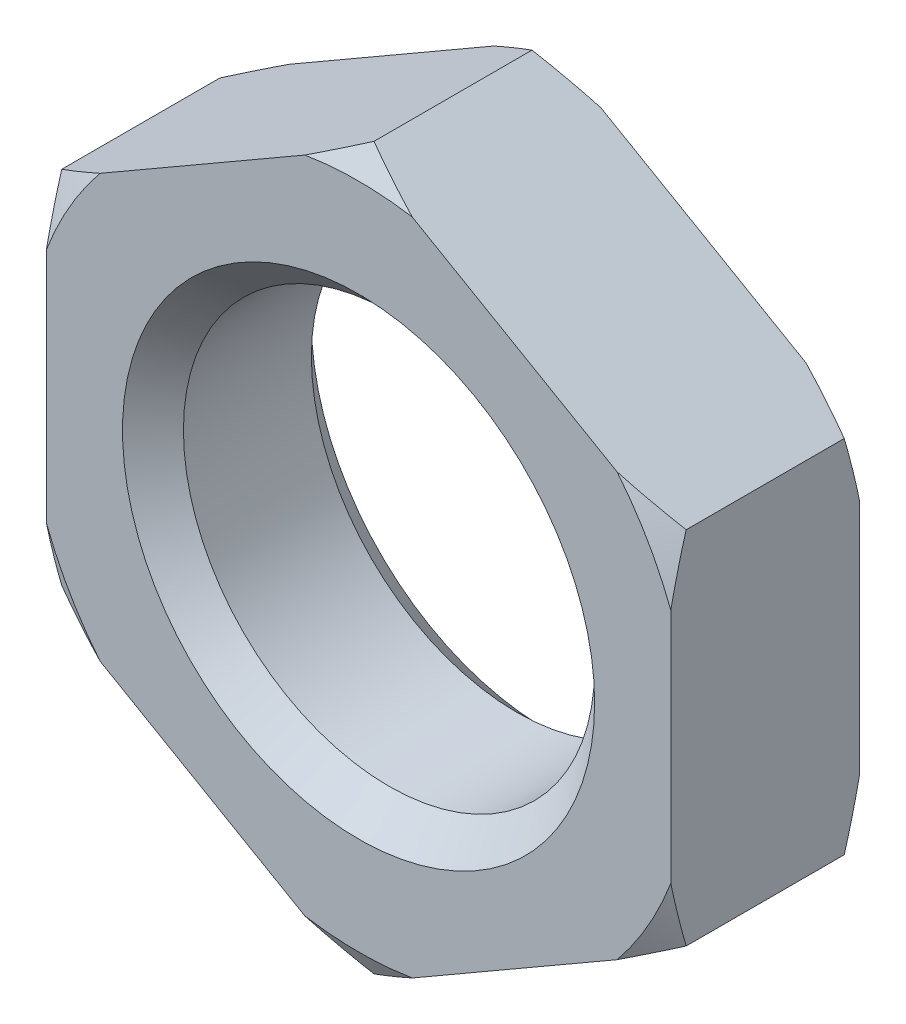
from build123d import *

# Parameters (mm, degrees)
SKETCH1_R           = 13.5
BOSS_EXTRUDE1_DEPTH = 6.2
CHAMFER1_SIZE       = 2


with BuildPart() as part:
    # Sketch1 → Boss-Extrude1 (new, symmetric)
    with BuildSketch(Plane.XY):
        Polygon((0, 23.671361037), (-20.5, 11.835680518), (-20.5, -11.835680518), (0, -23.671361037), (20.5, -11.835680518), (20.5, 11.835680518), align=None)
        with Locations(Location((0, 0, 0), (0, 0, 180))):
            Circle(SKETCH1_R, mode=Mode.SUBTRACT)
    extrude(amount=BOSS_EXTRUDE1_DEPTH, both=True)

    # Sketch3 → Cut-Revolve1 (revolve, cut)
    with BuildSketch(Plane(origin=(0, 0, 0), x_dir=(0, 0, -1), z_dir=(1, 0, 0))):
        Polygon((-6.2, 23.671361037), (-6.2, 21.921361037), (-5.189637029, 23.671361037), align=None)
    cut_revolve1 = revolve(axis=Axis((0, 0, -7.477018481), (0, 0, 1)), mode=Mode.SUBTRACT)

    # Mirror1: Cut-Revolve1 across plane
    add(cut_revolve1.mirror(Plane.XY), mode=Mode.SUBTRACT)

    # Chamfer1
    chamfer1_edges = [part.edges().sort_by_distance(p)[0] for p in [
        (13.5, 0, -6.2),
        (13.5, 0, 6.2),
    ]]
    chamfer(chamfer1_edges, length=CHAMFER1_SIZE)


solid = part.part
